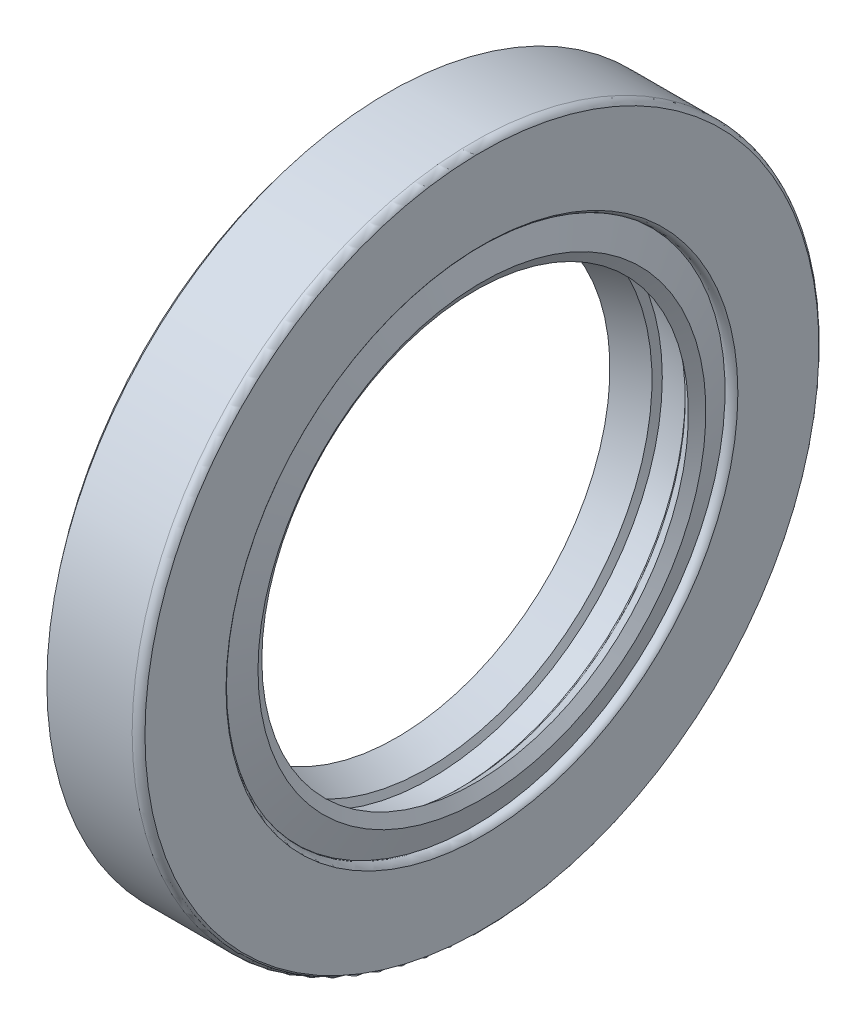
ISO-10303-21;
HEADER;
FILE_DESCRIPTION(('STEP AP214'),'2;1');
FILE_NAME('part.step','',(''),(''),'','','');
FILE_SCHEMA(('AUTOMOTIVE_DESIGN { 1 0 10303 214 1 1 1 1 }'));
ENDSEC;
DATA;
#1=APPLICATION_CONTEXT('core data for automotive mechanical design processes');
#2=APPLICATION_PROTOCOL_DEFINITION('international standard','automotive_design',2000,#1);
#3=PRODUCT_CONTEXT('',#1,'mechanical');
#4=PRODUCT('Part','Part','',(#3));
#5=PRODUCT_RELATED_PRODUCT_CATEGORY('part','',(#4));
#6=PRODUCT_DEFINITION_FORMATION('','',#4);
#7=PRODUCT_DEFINITION_CONTEXT('part definition',#1,'design');
#8=PRODUCT_DEFINITION('design','',#6,#7);
#9=PRODUCT_DEFINITION_SHAPE('','',#8);
#10=(LENGTH_UNIT() NAMED_UNIT(*) SI_UNIT(.MILLI.,.METRE.));
#11=(NAMED_UNIT(*) PLANE_ANGLE_UNIT() SI_UNIT($,.RADIAN.));
#12=(NAMED_UNIT(*) SI_UNIT($,.STERADIAN.) SOLID_ANGLE_UNIT());
#13=UNCERTAINTY_MEASURE_WITH_UNIT(LENGTH_MEASURE(1.E-05),#10,'distance_accuracy_value','');
#14=(GEOMETRIC_REPRESENTATION_CONTEXT(3) GLOBAL_UNCERTAINTY_ASSIGNED_CONTEXT((#13)) GLOBAL_UNIT_ASSIGNED_CONTEXT((#10,
#11,#12)) REPRESENTATION_CONTEXT('',''));
#15=CARTESIAN_POINT('',(0.,0.,0.));
#16=DIRECTION('',(0.,0.,1.));
#17=DIRECTION('',(1.,0.,0.));
#18=AXIS2_PLACEMENT_3D('',#15,#16,#17);
#19=CARTESIAN_POINT('',(0.,0.,0.));
#20=DIRECTION('',(-1.,0.,0.));
#21=DIRECTION('',(0.,0.,1.));
#22=AXIS2_PLACEMENT_3D('',#19,#20,#21);
#23=CYLINDRICAL_SURFACE('',#22,20.);
#24=CARTESIAN_POINT('',(5.5,0.,0.));
#25=DIRECTION('',(-1.,0.,0.));
#26=DIRECTION('',(0.,0.,1.));
#27=AXIS2_PLACEMENT_3D('',#24,#25,#26);
#28=CIRCLE('',#27,20.);
#29=CARTESIAN_POINT('',(5.5,0.,20.));
#30=VERTEX_POINT('',#29);
#31=EDGE_CURVE('E10',#30,#30,#28,.T.);
#32=ORIENTED_EDGE('',*,*,#31,.T.);
#33=EDGE_LOOP('',(#32));
#34=FACE_BOUND('',#33,.T.);
#35=CARTESIAN_POINT('',(0.5,0.,0.));
#36=DIRECTION('',(-1.,0.,0.));
#37=DIRECTION('',(0.,0.,1.));
#38=AXIS2_PLACEMENT_3D('',#35,#36,#37);
#39=CIRCLE('',#38,20.);
#40=CARTESIAN_POINT('',(0.5,0.,20.));
#41=VERTEX_POINT('',#40);
#42=EDGE_CURVE('E95',#41,#41,#39,.T.);
#43=ORIENTED_EDGE('',*,*,#42,.F.);
#44=EDGE_LOOP('',(#43));
#45=FACE_BOUND('',#44,.T.);
#46=ADVANCED_FACE('F28',(#34,#45),#23,.T.);
#47=CARTESIAN_POINT('',(5.56459503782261,0.,0.));
#48=DIRECTION('',(-1.,0.,0.));
#49=DIRECTION('',(0.,0.,1.));
#50=AXIS2_PLACEMENT_3D('',#47,#48,#49);
#51=TOROIDAL_SURFACE('',#50,19.5041900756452,0.5);
#52=ORIENTED_EDGE('',*,*,#31,.F.);
#53=EDGE_LOOP('',(#52));
#54=FACE_BOUND('',#53,.T.);
#55=CARTESIAN_POINT('',(6.,0.,0.));
#56=DIRECTION('',(-1.,0.,0.));
#57=DIRECTION('',(0.,0.,1.));
#58=AXIS2_PLACEMENT_3D('',#55,#56,#57);
#59=CIRCLE('',#58,19.75);
#60=CARTESIAN_POINT('',(6.,0.,19.75));
#61=VERTEX_POINT('',#60);
#62=EDGE_CURVE('E34',#61,#61,#59,.T.);
#63=ORIENTED_EDGE('',*,*,#62,.T.);
#64=EDGE_LOOP('',(#63));
#65=FACE_BOUND('',#64,.T.);
#66=ADVANCED_FACE('F103',(#54,#65),#51,.T.);
#67=CARTESIAN_POINT('',(6.,19.75,0.));
#68=DIRECTION('',(1.,0.,0.));
#69=DIRECTION('',(0.,0.,-1.));
#70=AXIS2_PLACEMENT_3D('',#67,#68,#69);
#71=PLANE('',#70);
#72=CARTESIAN_POINT('',(6.,0.,0.));
#73=DIRECTION('',(-1.,0.,0.));
#74=DIRECTION('',(0.,0.,1.));
#75=AXIS2_PLACEMENT_3D('',#72,#73,#74);
#76=CIRCLE('',#75,15.);
#77=CARTESIAN_POINT('',(6.,0.,15.));
#78=VERTEX_POINT('',#77);
#79=EDGE_CURVE('E38',#78,#78,#76,.T.);
#80=ORIENTED_EDGE('',*,*,#79,.T.);
#81=EDGE_LOOP('',(#80));
#82=FACE_BOUND('',#81,.T.);
#83=ORIENTED_EDGE('',*,*,#62,.F.);
#84=EDGE_LOOP('',(#83));
#85=FACE_BOUND('',#84,.T.);
#86=ADVANCED_FACE('F107',(#82,#85),#71,.T.);
#87=CARTESIAN_POINT('',(5.56459503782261,0.,0.));
#88=DIRECTION('',(-1.,0.,0.));
#89=DIRECTION('',(0.,0.,1.));
#90=AXIS2_PLACEMENT_3D('',#87,#88,#89);
#91=TOROIDAL_SURFACE('',#90,15.2458099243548,0.5);
#92=ORIENTED_EDGE('',*,*,#79,.F.);
#93=EDGE_LOOP('',(#92));
#94=FACE_BOUND('',#93,.T.);
#95=CARTESIAN_POINT('',(5.5,0.,0.));
#96=DIRECTION('',(-1.,0.,0.));
#97=DIRECTION('',(0.,0.,1.));
#98=AXIS2_PLACEMENT_3D('',#95,#96,#97);
#99=CIRCLE('',#98,14.75);
#100=CARTESIAN_POINT('',(5.5,0.,14.75));
#101=VERTEX_POINT('',#100);
#102=EDGE_CURVE('E42',#101,#101,#99,.T.);
#103=ORIENTED_EDGE('',*,*,#102,.T.);
#104=EDGE_LOOP('',(#103));
#105=FACE_BOUND('',#104,.T.);
#106=ADVANCED_FACE('F112',(#94,#105),#91,.T.);
#107=CARTESIAN_POINT('',(6.,0.,0.));
#108=DIRECTION('',(-1.,0.,0.));
#109=DIRECTION('',(0.,0.,1.));
#110=AXIS2_PLACEMENT_3D('',#107,#108,#109);
#111=CONICAL_SURFACE('',#110,13.125,1.27229739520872);
#112=ORIENTED_EDGE('',*,*,#102,.F.);
#113=EDGE_LOOP('',(#112));
#114=FACE_BOUND('',#113,.T.);
#115=CARTESIAN_POINT('',(6.,0.,0.));
#116=DIRECTION('',(-1.,0.,0.));
#117=DIRECTION('',(0.,0.,1.));
#118=AXIS2_PLACEMENT_3D('',#115,#116,#117);
#119=CIRCLE('',#118,13.125);
#120=CARTESIAN_POINT('',(6.,0.,13.125));
#121=VERTEX_POINT('',#120);
#122=EDGE_CURVE('E47',#121,#121,#119,.T.);
#123=ORIENTED_EDGE('',*,*,#122,.T.);
#124=EDGE_LOOP('',(#123));
#125=FACE_BOUND('',#124,.T.);
#126=ADVANCED_FACE('F118',(#114,#125),#111,.T.);
#127=CARTESIAN_POINT('',(5.6,0.,0.));
#128=DIRECTION('',(1.,0.,0.));
#129=DIRECTION('',(0.,0.,-1.));
#130=AXIS2_PLACEMENT_3D('',#127,#128,#129);
#131=CONICAL_SURFACE('',#130,12.5,1.00148313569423);
#132=ORIENTED_EDGE('',*,*,#122,.F.);
#133=EDGE_LOOP('',(#132));
#134=FACE_BOUND('',#133,.T.);
#135=CARTESIAN_POINT('',(5.6,0.,0.));
#136=DIRECTION('',(-1.,0.,0.));
#137=DIRECTION('',(0.,0.,1.));
#138=AXIS2_PLACEMENT_3D('',#135,#136,#137);
#139=CIRCLE('',#138,12.5);
#140=CARTESIAN_POINT('',(5.6,0.,12.5));
#141=VERTEX_POINT('',#140);
#142=EDGE_CURVE('E50',#141,#141,#139,.T.);
#143=ORIENTED_EDGE('',*,*,#142,.T.);
#144=EDGE_LOOP('',(#143));
#145=FACE_BOUND('',#144,.T.);
#146=ADVANCED_FACE('F122',(#134,#145),#131,.F.);
#147=CARTESIAN_POINT('',(4.75,0.,0.));
#148=DIRECTION('',(-1.,0.,0.));
#149=DIRECTION('',(0.,0.,1.));
#150=AXIS2_PLACEMENT_3D('',#147,#148,#149);
#151=CONICAL_SURFACE('',#150,13.1666666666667,0.665102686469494);
#152=ORIENTED_EDGE('',*,*,#142,.F.);
#153=EDGE_LOOP('',(#152));
#154=FACE_BOUND('',#153,.T.);
#155=CARTESIAN_POINT('',(4.75,0.,0.));
#156=DIRECTION('',(-1.,0.,0.));
#157=DIRECTION('',(0.,0.,1.));
#158=AXIS2_PLACEMENT_3D('',#155,#156,#157);
#159=CIRCLE('',#158,13.1666666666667);
#160=CARTESIAN_POINT('',(4.75,0.,13.1666666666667));
#161=VERTEX_POINT('',#160);
#162=EDGE_CURVE('E53',#161,#161,#159,.T.);
#163=ORIENTED_EDGE('',*,*,#162,.T.);
#164=EDGE_LOOP('',(#163));
#165=FACE_BOUND('',#164,.T.);
#166=ADVANCED_FACE('F126',(#154,#165),#151,.F.);
#167=CARTESIAN_POINT('',(4.29428108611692,0.,0.));
#168=DIRECTION('',(-1.,0.,0.));
#169=DIRECTION('',(0.,0.,1.));
#170=AXIS2_PLACEMENT_3D('',#167,#168,#169);
#171=TOROIDAL_SURFACE('',#170,12.9609477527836,0.5);
#172=CARTESIAN_POINT('',(4.5,0.,0.));
#173=DIRECTION('',(-1.,0.,0.));
#174=DIRECTION('',(0.,0.,1.));
#175=AXIS2_PLACEMENT_3D('',#172,#173,#174);
#176=CIRCLE('',#175,13.4166666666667);
#177=CARTESIAN_POINT('',(4.5,0.,13.4166666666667));
#178=VERTEX_POINT('',#177);
#179=EDGE_CURVE('E56',#178,#178,#176,.T.);
#180=ORIENTED_EDGE('',*,*,#179,.T.);
#181=EDGE_LOOP('',(#180));
#182=FACE_BOUND('',#181,.T.);
#183=ORIENTED_EDGE('',*,*,#162,.F.);
#184=EDGE_LOOP('',(#183));
#185=FACE_BOUND('',#184,.T.);
#186=ADVANCED_FACE('F130',(#182,#185),#171,.F.);
#187=CARTESIAN_POINT('',(3.,0.,0.));
#188=DIRECTION('',(-1.,0.,0.));
#189=DIRECTION('',(0.,0.,1.));
#190=AXIS2_PLACEMENT_3D('',#187,#188,#189);
#191=CONICAL_SURFACE('',#190,13.5714285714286,0.102810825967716);
#192=ORIENTED_EDGE('',*,*,#179,.F.);
#193=EDGE_LOOP('',(#192));
#194=FACE_BOUND('',#193,.T.);
#195=CARTESIAN_POINT('',(3.,0.,0.));
#196=DIRECTION('',(-1.,0.,0.));
#197=DIRECTION('',(0.,0.,1.));
#198=AXIS2_PLACEMENT_3D('',#195,#196,#197);
#199=CIRCLE('',#198,13.5714285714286);
#200=CARTESIAN_POINT('',(3.,0.,13.5714285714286));
#201=VERTEX_POINT('',#200);
#202=EDGE_CURVE('E59',#201,#201,#199,.T.);
#203=ORIENTED_EDGE('',*,*,#202,.T.);
#204=EDGE_LOOP('',(#203));
#205=FACE_BOUND('',#204,.T.);
#206=ADVANCED_FACE('F134',(#194,#205),#191,.F.);
#207=CARTESIAN_POINT('',(3.,0.,0.));
#208=DIRECTION('',(1.,0.,0.));
#209=DIRECTION('',(0.,0.,-1.));
#210=AXIS2_PLACEMENT_3D('',#207,#208,#209);
#211=CONICAL_SURFACE('',#210,13.5714285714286,1.1118656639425);
#212=CARTESIAN_POINT('',(2.8,0.,0.));
#213=DIRECTION('',(-1.,0.,0.));
#214=DIRECTION('',(0.,0.,1.));
#215=AXIS2_PLACEMENT_3D('',#212,#213,#214);
#216=CIRCLE('',#215,13.1666666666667);
#217=CARTESIAN_POINT('',(2.8,0.,13.1666666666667));
#218=VERTEX_POINT('',#217);
#219=EDGE_CURVE('E62',#218,#218,#216,.T.);
#220=ORIENTED_EDGE('',*,*,#219,.T.);
#221=EDGE_LOOP('',(#220));
#222=FACE_BOUND('',#221,.T.);
#223=ORIENTED_EDGE('',*,*,#202,.F.);
#224=EDGE_LOOP('',(#223));
#225=FACE_BOUND('',#224,.T.);
#226=ADVANCED_FACE('F138',(#222,#225),#211,.F.);
#227=CARTESIAN_POINT('',(2.8,0.,0.));
#228=DIRECTION('',(1.,0.,0.));
#229=DIRECTION('',(0.,0.,-1.));
#230=AXIS2_PLACEMENT_3D('',#227,#228,#229);
#231=CONICAL_SURFACE('',#230,13.1666666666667,0.35470565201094);
#232=CARTESIAN_POINT('',(1.,0.,0.));
#233=DIRECTION('',(-1.,0.,0.));
#234=DIRECTION('',(0.,0.,1.));
#235=AXIS2_PLACEMENT_3D('',#232,#233,#234);
#236=CIRCLE('',#235,12.5);
#237=CARTESIAN_POINT('',(1.,0.,12.5));
#238=VERTEX_POINT('',#237);
#239=EDGE_CURVE('E65',#238,#238,#236,.T.);
#240=ORIENTED_EDGE('',*,*,#239,.T.);
#241=EDGE_LOOP('',(#240));
#242=FACE_BOUND('',#241,.T.);
#243=ORIENTED_EDGE('',*,*,#219,.F.);
#244=EDGE_LOOP('',(#243));
#245=FACE_BOUND('',#244,.T.);
#246=ADVANCED_FACE('F142',(#242,#245),#231,.F.);
#247=CARTESIAN_POINT('',(1.,0.,0.));
#248=DIRECTION('',(-1.,0.,0.));
#249=DIRECTION('',(0.,0.,1.));
#250=AXIS2_PLACEMENT_3D('',#247,#248,#249);
#251=CONICAL_SURFACE('',#250,12.5,1.06030800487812);
#252=CARTESIAN_POINT('',(0.4,0.,0.));
#253=DIRECTION('',(-1.,0.,0.));
#254=DIRECTION('',(0.,0.,1.));
#255=AXIS2_PLACEMENT_3D('',#252,#253,#254);
#256=CIRCLE('',#255,13.5714285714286);
#257=CARTESIAN_POINT('',(0.4,0.,13.5714285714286));
#258=VERTEX_POINT('',#257);
#259=EDGE_CURVE('E68',#258,#258,#256,.T.);
#260=ORIENTED_EDGE('',*,*,#259,.T.);
#261=EDGE_LOOP('',(#260));
#262=FACE_BOUND('',#261,.T.);
#263=ORIENTED_EDGE('',*,*,#239,.F.);
#264=EDGE_LOOP('',(#263));
#265=FACE_BOUND('',#264,.T.);
#266=ADVANCED_FACE('F146',(#262,#265),#251,.F.);
#267=CARTESIAN_POINT('',(0.4,13.5714285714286,0.));
#268=DIRECTION('',(-1.,0.,0.));
#269=DIRECTION('',(0.,0.,1.));
#270=AXIS2_PLACEMENT_3D('',#267,#268,#269);
#271=PLANE('',#270);
#272=CARTESIAN_POINT('',(0.4,0.,0.));
#273=DIRECTION('',(-1.,0.,0.));
#274=DIRECTION('',(0.,0.,1.));
#275=AXIS2_PLACEMENT_3D('',#272,#273,#274);
#276=CIRCLE('',#275,15.1296729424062);
#277=CARTESIAN_POINT('',(0.4,0.,15.1296729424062));
#278=VERTEX_POINT('',#277);
#279=EDGE_CURVE('E71',#278,#278,#276,.T.);
#280=ORIENTED_EDGE('',*,*,#279,.T.);
#281=EDGE_LOOP('',(#280));
#282=FACE_BOUND('',#281,.T.);
#283=ORIENTED_EDGE('',*,*,#259,.F.);
#284=EDGE_LOOP('',(#283));
#285=FACE_BOUND('',#284,.T.);
#286=ADVANCED_FACE('F150',(#282,#285),#271,.T.);
#287=CARTESIAN_POINT('',(0.,0.,0.));
#288=DIRECTION('',(-1.,0.,0.));
#289=DIRECTION('',(0.,0.,1.));
#290=AXIS2_PLACEMENT_3D('',#287,#288,#289);
#291=CYLINDRICAL_SURFACE('',#290,15.1296729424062);
#292=CARTESIAN_POINT('',(1.13449521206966,0.,0.));
#293=DIRECTION('',(-1.,0.,0.));
#294=DIRECTION('',(0.,0.,1.));
#295=AXIS2_PLACEMENT_3D('',#292,#293,#294);
#296=CIRCLE('',#295,15.1296729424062);
#297=CARTESIAN_POINT('',(1.13449521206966,0.,15.1296729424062));
#298=VERTEX_POINT('',#297);
#299=EDGE_CURVE('E74',#298,#298,#296,.T.);
#300=ORIENTED_EDGE('',*,*,#299,.T.);
#301=EDGE_LOOP('',(#300));
#302=FACE_BOUND('',#301,.T.);
#303=ORIENTED_EDGE('',*,*,#279,.F.);
#304=EDGE_LOOP('',(#303));
#305=FACE_BOUND('',#304,.T.);
#306=ADVANCED_FACE('F154',(#302,#305),#291,.T.);
#307=CARTESIAN_POINT('',(1.5,0.,0.));
#308=DIRECTION('',(-1.,0.,0.));
#309=DIRECTION('',(0.,0.,1.));
#310=AXIS2_PLACEMENT_3D('',#307,#308,#309);
#311=TOROIDAL_SURFACE('',#310,14.375,0.838525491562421);
#312=ORIENTED_EDGE('',*,*,#299,.F.);
#313=EDGE_LOOP('',(#312));
#314=FACE_BOUND('',#313,.T.);
#315=CARTESIAN_POINT('',(2.303686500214,0.,0.));
#316=DIRECTION('',(-1.,0.,0.));
#317=DIRECTION('',(0.,0.,1.));
#318=AXIS2_PLACEMENT_3D('',#315,#316,#317);
#319=CIRCLE('',#318,14.614192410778);
#320=CARTESIAN_POINT('',(2.303686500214,0.,14.614192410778));
#321=VERTEX_POINT('',#320);
#322=EDGE_CURVE('E77',#321,#321,#319,.T.);
#323=ORIENTED_EDGE('',*,*,#322,.T.);
#324=EDGE_LOOP('',(#323));
#325=FACE_BOUND('',#324,.T.);
#326=ADVANCED_FACE('F158',(#314,#325),#311,.T.);
#327=CARTESIAN_POINT('',(3.6,0.,0.));
#328=DIRECTION('',(1.,0.,0.));
#329=DIRECTION('',(0.,0.,-1.));
#330=AXIS2_PLACEMENT_3D('',#327,#328,#329);
#331=CONICAL_SURFACE('',#330,15.,0.289271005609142);
#332=ORIENTED_EDGE('',*,*,#322,.F.);
#333=EDGE_LOOP('',(#332));
#334=FACE_BOUND('',#333,.T.);
#335=CARTESIAN_POINT('',(3.6,0.,0.));
#336=DIRECTION('',(-1.,0.,0.));
#337=DIRECTION('',(0.,0.,1.));
#338=AXIS2_PLACEMENT_3D('',#335,#336,#337);
#339=CIRCLE('',#338,15.);
#340=CARTESIAN_POINT('',(3.6,0.,15.));
#341=VERTEX_POINT('',#340);
#342=EDGE_CURVE('E80',#341,#341,#339,.T.);
#343=ORIENTED_EDGE('',*,*,#342,.T.);
#344=EDGE_LOOP('',(#343));
#345=FACE_BOUND('',#344,.T.);
#346=ADVANCED_FACE('F162',(#334,#345),#331,.T.);
#347=CARTESIAN_POINT('',(3.6,17.875,0.));
#348=DIRECTION('',(1.,0.,0.));
#349=DIRECTION('',(0.,0.,-1.));
#350=AXIS2_PLACEMENT_3D('',#347,#348,#349);
#351=PLANE('',#350);
#352=ORIENTED_EDGE('',*,*,#342,.F.);
#353=EDGE_LOOP('',(#352));
#354=FACE_BOUND('',#353,.T.);
#355=CARTESIAN_POINT('',(3.6,0.,0.));
#356=DIRECTION('',(-1.,0.,0.));
#357=DIRECTION('',(0.,0.,1.));
#358=AXIS2_PLACEMENT_3D('',#355,#356,#357);
#359=CIRCLE('',#358,17.875);
#360=CARTESIAN_POINT('',(3.6,0.,17.875));
#361=VERTEX_POINT('',#360);
#362=EDGE_CURVE('E83',#361,#361,#359,.T.);
#363=ORIENTED_EDGE('',*,*,#362,.T.);
#364=EDGE_LOOP('',(#363));
#365=FACE_BOUND('',#364,.T.);
#366=ADVANCED_FACE('F166',(#354,#365),#351,.F.);
#367=CARTESIAN_POINT('',(3.14428108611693,0.,0.));
#368=DIRECTION('',(-1.,0.,0.));
#369=DIRECTION('',(0.,0.,1.));
#370=AXIS2_PLACEMENT_3D('',#367,#368,#369);
#371=TOROIDAL_SURFACE('',#370,17.669281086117,0.5);
#372=CARTESIAN_POINT('',(3.35,0.,0.));
#373=DIRECTION('',(-1.,0.,0.));
#374=DIRECTION('',(0.,0.,1.));
#375=AXIS2_PLACEMENT_3D('',#372,#373,#374);
#376=CIRCLE('',#375,18.125);
#377=CARTESIAN_POINT('',(3.35,0.,18.125));
#378=VERTEX_POINT('',#377);
#379=EDGE_CURVE('E86',#378,#378,#376,.T.);
#380=ORIENTED_EDGE('',*,*,#379,.T.);
#381=EDGE_LOOP('',(#380));
#382=FACE_BOUND('',#381,.T.);
#383=ORIENTED_EDGE('',*,*,#362,.F.);
#384=EDGE_LOOP('',(#383));
#385=FACE_BOUND('',#384,.T.);
#386=ADVANCED_FACE('F170',(#382,#385),#371,.F.);
#387=CARTESIAN_POINT('',(0.,0.,0.));
#388=DIRECTION('',(-1.,0.,0.));
#389=DIRECTION('',(0.,0.,1.));
#390=AXIS2_PLACEMENT_3D('',#387,#388,#389);
#391=CONICAL_SURFACE('',#390,18.5,0.111476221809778);
#392=ORIENTED_EDGE('',*,*,#379,.F.);
#393=EDGE_LOOP('',(#392));
#394=FACE_BOUND('',#393,.T.);
#395=CARTESIAN_POINT('',(0.,0.,0.));
#396=DIRECTION('',(-1.,0.,0.));
#397=DIRECTION('',(0.,0.,1.));
#398=AXIS2_PLACEMENT_3D('',#395,#396,#397);
#399=CIRCLE('',#398,18.5);
#400=CARTESIAN_POINT('',(0.,0.,18.5));
#401=VERTEX_POINT('',#400);
#402=EDGE_CURVE('E89',#401,#401,#399,.T.);
#403=ORIENTED_EDGE('',*,*,#402,.T.);
#404=EDGE_LOOP('',(#403));
#405=FACE_BOUND('',#404,.T.);
#406=ADVANCED_FACE('F174',(#394,#405),#391,.F.);
#407=CARTESIAN_POINT('',(0.,18.5,0.));
#408=DIRECTION('',(-1.,0.,0.));
#409=DIRECTION('',(0.,0.,1.));
#410=AXIS2_PLACEMENT_3D('',#407,#408,#409);
#411=PLANE('',#410);
#412=CARTESIAN_POINT('',(0.,0.,0.));
#413=DIRECTION('',(-1.,0.,0.));
#414=DIRECTION('',(0.,0.,1.));
#415=AXIS2_PLACEMENT_3D('',#412,#413,#414);
#416=CIRCLE('',#415,19.375);
#417=CARTESIAN_POINT('',(0.,0.,19.375));
#418=VERTEX_POINT('',#417);
#419=EDGE_CURVE('E92',#418,#418,#416,.T.);
#420=ORIENTED_EDGE('',*,*,#419,.T.);
#421=EDGE_LOOP('',(#420));
#422=FACE_BOUND('',#421,.T.);
#423=ORIENTED_EDGE('',*,*,#402,.F.);
#424=EDGE_LOOP('',(#423));
#425=FACE_BOUND('',#424,.T.);
#426=ADVANCED_FACE('F178',(#422,#425),#411,.T.);
#427=CARTESIAN_POINT('',(0.,0.,0.));
#428=DIRECTION('',(1.,0.,0.));
#429=DIRECTION('',(0.,0.,-1.));
#430=AXIS2_PLACEMENT_3D('',#427,#428,#429);
#431=CONICAL_SURFACE('',#430,19.375,0.896055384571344);
#432=ORIENTED_EDGE('',*,*,#42,.T.);
#433=EDGE_LOOP('',(#432));
#434=FACE_BOUND('',#433,.T.);
#435=ORIENTED_EDGE('',*,*,#419,.F.);
#436=EDGE_LOOP('',(#435));
#437=FACE_BOUND('',#436,.T.);
#438=ADVANCED_FACE('F99',(#434,#437),#431,.T.);
#439=CLOSED_SHELL('',(#46,#66,#86,#106,#126,#146,#166,#186,#206,#226,#246,#266,#286,#306,#326,
#346,#366,#386,#406,#426,#438));
#440=MANIFOLD_SOLID_BREP('B2',#439);
#441=ADVANCED_BREP_SHAPE_REPRESENTATION('',(#18,#440),#14);
#442=SHAPE_DEFINITION_REPRESENTATION(#9,#441);
ENDSEC;
END-ISO-10303-21;
